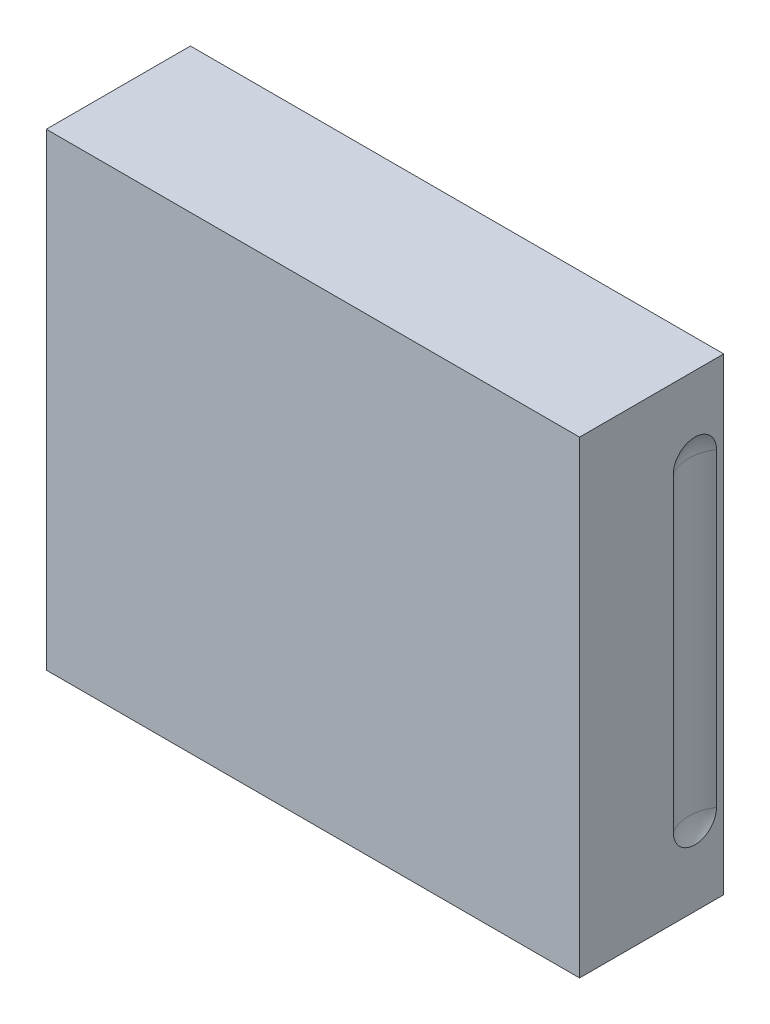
ISO-10303-21;
HEADER;
FILE_DESCRIPTION(('STEP AP214'),'2;1');
FILE_NAME('part.step','',(''),(''),'','','');
FILE_SCHEMA(('AUTOMOTIVE_DESIGN { 1 0 10303 214 1 1 1 1 }'));
ENDSEC;
DATA;
#1=APPLICATION_CONTEXT('core data for automotive mechanical design processes');
#2=APPLICATION_PROTOCOL_DEFINITION('international standard','automotive_design',2000,#1);
#3=PRODUCT_CONTEXT('',#1,'mechanical');
#4=PRODUCT('Part','Part','',(#3));
#5=PRODUCT_RELATED_PRODUCT_CATEGORY('part','',(#4));
#6=PRODUCT_DEFINITION_FORMATION('','',#4);
#7=PRODUCT_DEFINITION_CONTEXT('part definition',#1,'design');
#8=PRODUCT_DEFINITION('design','',#6,#7);
#9=PRODUCT_DEFINITION_SHAPE('','',#8);
#10=(LENGTH_UNIT() NAMED_UNIT(*) SI_UNIT(.MILLI.,.METRE.));
#11=(NAMED_UNIT(*) PLANE_ANGLE_UNIT() SI_UNIT($,.RADIAN.));
#12=(NAMED_UNIT(*) SI_UNIT($,.STERADIAN.) SOLID_ANGLE_UNIT());
#13=UNCERTAINTY_MEASURE_WITH_UNIT(LENGTH_MEASURE(1.E-05),#10,'distance_accuracy_value','');
#14=(GEOMETRIC_REPRESENTATION_CONTEXT(3) GLOBAL_UNCERTAINTY_ASSIGNED_CONTEXT((#13)) GLOBAL_UNIT_ASSIGNED_CONTEXT((#10,
#11,#12)) REPRESENTATION_CONTEXT('',''));
#15=CARTESIAN_POINT('',(0.,0.,0.));
#16=DIRECTION('',(0.,0.,1.));
#17=DIRECTION('',(1.,0.,0.));
#18=AXIS2_PLACEMENT_3D('',#15,#16,#17);
#19=CARTESIAN_POINT('',(48.9999999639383,65.,11.7));
#20=DIRECTION('',(0.,0.,1.));
#21=DIRECTION('',(1.,0.,0.));
#22=AXIS2_PLACEMENT_3D('',#19,#20,#21);
#23=PLANE('',#22);
#24=DIRECTION('',(0.,1.,0.));
#25=VECTOR('',#24,1.);
#26=CARTESIAN_POINT('',(61.,65.,11.7));
#27=LINE('',#26,#25);
#28=CARTESIAN_POINT('',(61.,43.2,11.7));
#29=VERTEX_POINT('',#28);
#30=CARTESIAN_POINT('',(61.,86.8,11.7));
#31=VERTEX_POINT('',#30);
#32=EDGE_CURVE('E123',#29,#31,#27,.T.);
#33=ORIENTED_EDGE('',*,*,#32,.F.);
#34=CARTESIAN_POINT('',(56.,43.2,11.7));
#35=DIRECTION('',(0.,0.,-1.));
#36=DIRECTION('',(-1.,0.,0.));
#37=AXIS2_PLACEMENT_3D('',#34,#35,#36);
#38=CIRCLE('',#37,5.);
#39=CARTESIAN_POINT('',(56.,38.2000000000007,11.7));
#40=VERTEX_POINT('',#39);
#41=EDGE_CURVE('E18',#40,#29,#38,.F.);
#42=ORIENTED_EDGE('',*,*,#41,.F.);
#43=DIRECTION('',(1.,0.,0.));
#44=VECTOR('',#43,1.);
#45=CARTESIAN_POINT('',(48.9999999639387,38.2000000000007,11.7));
#46=LINE('',#45,#44);
#47=CARTESIAN_POINT('',(42.,38.2,11.7));
#48=VERTEX_POINT('',#47);
#49=EDGE_CURVE('E145',#48,#40,#46,.T.);
#50=ORIENTED_EDGE('',*,*,#49,.F.);
#51=CARTESIAN_POINT('',(42.,43.2,11.7));
#52=DIRECTION('',(0.,0.,-1.));
#53=DIRECTION('',(-1.,0.,0.));
#54=AXIS2_PLACEMENT_3D('',#51,#52,#53);
#55=CIRCLE('',#54,5.);
#56=CARTESIAN_POINT('',(37.,43.2,11.7));
#57=VERTEX_POINT('',#56);
#58=EDGE_CURVE('E153',#57,#48,#55,.F.);
#59=ORIENTED_EDGE('',*,*,#58,.F.);
#60=DIRECTION('',(0.,1.,0.));
#61=VECTOR('',#60,1.);
#62=CARTESIAN_POINT('',(37.,65.,11.7));
#63=LINE('',#62,#61);
#64=CARTESIAN_POINT('',(37.,86.8,11.7));
#65=VERTEX_POINT('',#64);
#66=EDGE_CURVE('E157',#65,#57,#63,.F.);
#67=ORIENTED_EDGE('',*,*,#66,.F.);
#68=CARTESIAN_POINT('',(42.,86.8,11.7));
#69=DIRECTION('',(0.,0.,-1.));
#70=DIRECTION('',(-1.,0.,0.));
#71=AXIS2_PLACEMENT_3D('',#68,#69,#70);
#72=CIRCLE('',#71,5.);
#73=CARTESIAN_POINT('',(42.,91.8,11.7));
#74=VERTEX_POINT('',#73);
#75=EDGE_CURVE('E295',#74,#65,#72,.F.);
#76=ORIENTED_EDGE('',*,*,#75,.F.);
#77=DIRECTION('',(1.,0.,0.));
#78=VECTOR('',#77,1.);
#79=CARTESIAN_POINT('',(48.9999999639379,91.8,11.7));
#80=LINE('',#79,#78);
#81=CARTESIAN_POINT('',(56.,91.8,11.7));
#82=VERTEX_POINT('',#81);
#83=EDGE_CURVE('E291',#82,#74,#80,.F.);
#84=ORIENTED_EDGE('',*,*,#83,.F.);
#85=CARTESIAN_POINT('',(56.,86.8,11.7));
#86=DIRECTION('',(0.,0.,-1.));
#87=DIRECTION('',(-1.,0.,0.));
#88=AXIS2_PLACEMENT_3D('',#85,#86,#87);
#89=CIRCLE('',#88,5.);
#90=EDGE_CURVE('E126',#31,#82,#89,.F.);
#91=ORIENTED_EDGE('',*,*,#90,.F.);
#92=EDGE_LOOP('',(#33,#42,#50,#59,#67,#76,#84,#91));
#93=FACE_BOUND('',#92,.T.);
#94=ADVANCED_FACE('F14',(#93),#23,.F.);
#95=CARTESIAN_POINT('',(61.,65.,5.85));
#96=DIRECTION('',(-1.,0.,0.));
#97=DIRECTION('',(0.,0.,1.));
#98=AXIS2_PLACEMENT_3D('',#95,#96,#97);
#99=PLANE('',#98);
#100=DIRECTION('',(0.,0.,-1.));
#101=VECTOR('',#100,1.);
#102=CARTESIAN_POINT('',(61.,86.8,5.85));
#103=LINE('',#102,#101);
#104=CARTESIAN_POINT('',(61.,86.8,0.));
#105=VERTEX_POINT('',#104);
#106=EDGE_CURVE('E286',#105,#31,#103,.F.);
#107=ORIENTED_EDGE('',*,*,#106,.F.);
#108=DIRECTION('',(0.,1.,0.));
#109=VECTOR('',#108,1.);
#110=CARTESIAN_POINT('',(61.,65.,0.));
#111=LINE('',#110,#109);
#112=CARTESIAN_POINT('',(61.,43.2,0.));
#113=VERTEX_POINT('',#112);
#114=EDGE_CURVE('E134',#105,#113,#111,.F.);
#115=ORIENTED_EDGE('',*,*,#114,.T.);
#116=DIRECTION('',(0.,0.,-1.));
#117=VECTOR('',#116,1.);
#118=CARTESIAN_POINT('',(61.,43.2,5.85));
#119=LINE('',#118,#117);
#120=EDGE_CURVE('E131',#29,#113,#119,.T.);
#121=ORIENTED_EDGE('',*,*,#120,.F.);
#122=ORIENTED_EDGE('',*,*,#32,.T.);
#123=EDGE_LOOP('',(#107,#115,#121,#122));
#124=FACE_BOUND('',#123,.T.);
#125=ADVANCED_FACE('F132',(#124),#99,.T.);
#126=CARTESIAN_POINT('',(56.,43.2,11.7));
#127=DIRECTION('',(0.,0.,-1.));
#128=DIRECTION('',(-1.,0.,0.));
#129=AXIS2_PLACEMENT_3D('',#126,#127,#128);
#130=CYLINDRICAL_SURFACE('',#129,5.);
#131=ORIENTED_EDGE('',*,*,#120,.T.);
#132=CARTESIAN_POINT('',(56.,43.2,0.));
#133=DIRECTION('',(0.,0.,-1.));
#134=DIRECTION('',(-1.,0.,0.));
#135=AXIS2_PLACEMENT_3D('',#132,#133,#134);
#136=CIRCLE('',#135,5.);
#137=CARTESIAN_POINT('',(56.,38.2,0.));
#138=VERTEX_POINT('',#137);
#139=EDGE_CURVE('E142',#113,#138,#136,.T.);
#140=ORIENTED_EDGE('',*,*,#139,.T.);
#141=DIRECTION('',(0.,0.,1.));
#142=VECTOR('',#141,1.);
#143=CARTESIAN_POINT('',(56.,38.2000000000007,5.85));
#144=LINE('',#143,#142);
#145=EDGE_CURVE('E137',#40,#138,#144,.F.);
#146=ORIENTED_EDGE('',*,*,#145,.F.);
#147=ORIENTED_EDGE('',*,*,#41,.T.);
#148=EDGE_LOOP('',(#131,#140,#146,#147));
#149=FACE_BOUND('',#148,.T.);
#150=ADVANCED_FACE('F139',(#149),#130,.F.);
#151=CARTESIAN_POINT('',(48.9999999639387,38.2000000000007,5.85));
#152=DIRECTION('',(0.,1.,0.));
#153=DIRECTION('',(0.,0.,1.));
#154=AXIS2_PLACEMENT_3D('',#151,#152,#153);
#155=PLANE('',#154);
#156=DIRECTION('',(0.,0.,-1.));
#157=VECTOR('',#156,1.);
#158=CARTESIAN_POINT('',(42.,38.2,5.85));
#159=LINE('',#158,#157);
#160=CARTESIAN_POINT('',(42.,38.2,0.));
#161=VERTEX_POINT('',#160);
#162=EDGE_CURVE('E150',#48,#161,#159,.T.);
#163=ORIENTED_EDGE('',*,*,#162,.F.);
#164=ORIENTED_EDGE('',*,*,#49,.T.);
#165=ORIENTED_EDGE('',*,*,#145,.T.);
#166=DIRECTION('',(1.,0.,0.));
#167=VECTOR('',#166,1.);
#168=CARTESIAN_POINT('',(48.9999999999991,38.2,0.));
#169=LINE('',#168,#167);
#170=EDGE_CURVE('E321',#138,#161,#169,.F.);
#171=ORIENTED_EDGE('',*,*,#170,.T.);
#172=EDGE_LOOP('',(#163,#164,#165,#171));
#173=FACE_BOUND('',#172,.T.);
#174=ADVANCED_FACE('F148',(#173),#155,.T.);
#175=CARTESIAN_POINT('',(42.,43.2,11.7));
#176=DIRECTION('',(0.,0.,-1.));
#177=DIRECTION('',(-1.,0.,0.));
#178=AXIS2_PLACEMENT_3D('',#175,#176,#177);
#179=CYLINDRICAL_SURFACE('',#178,5.);
#180=DIRECTION('',(0.,0.,-1.));
#181=VECTOR('',#180,1.);
#182=CARTESIAN_POINT('',(37.,43.2,5.85));
#183=LINE('',#182,#181);
#184=CARTESIAN_POINT('',(37.,43.2,0.));
#185=VERTEX_POINT('',#184);
#186=EDGE_CURVE('E296',#57,#185,#183,.T.);
#187=ORIENTED_EDGE('',*,*,#186,.F.);
#188=ORIENTED_EDGE('',*,*,#58,.T.);
#189=ORIENTED_EDGE('',*,*,#162,.T.);
#190=CARTESIAN_POINT('',(42.,43.2,0.));
#191=DIRECTION('',(0.,0.,-1.));
#192=DIRECTION('',(-1.,0.,0.));
#193=AXIS2_PLACEMENT_3D('',#190,#191,#192);
#194=CIRCLE('',#193,5.);
#195=EDGE_CURVE('E317',#161,#185,#194,.T.);
#196=ORIENTED_EDGE('',*,*,#195,.T.);
#197=EDGE_LOOP('',(#187,#188,#189,#196));
#198=FACE_BOUND('',#197,.T.);
#199=ADVANCED_FACE('F332',(#198),#179,.F.);
#200=CARTESIAN_POINT('',(37.,65.,5.85));
#201=DIRECTION('',(1.,0.,0.));
#202=DIRECTION('',(0.,0.,-1.));
#203=AXIS2_PLACEMENT_3D('',#200,#201,#202);
#204=PLANE('',#203);
#205=ORIENTED_EDGE('',*,*,#186,.T.);
#206=DIRECTION('',(0.,1.,0.));
#207=VECTOR('',#206,1.);
#208=CARTESIAN_POINT('',(37.,65.,0.));
#209=LINE('',#208,#207);
#210=CARTESIAN_POINT('',(37.,86.8,0.));
#211=VERTEX_POINT('',#210);
#212=EDGE_CURVE('E314',#185,#211,#209,.T.);
#213=ORIENTED_EDGE('',*,*,#212,.T.);
#214=DIRECTION('',(0.,0.,-1.));
#215=VECTOR('',#214,1.);
#216=CARTESIAN_POINT('',(37.,86.8,5.85));
#217=LINE('',#216,#215);
#218=EDGE_CURVE('E292',#65,#211,#217,.T.);
#219=ORIENTED_EDGE('',*,*,#218,.F.);
#220=ORIENTED_EDGE('',*,*,#66,.T.);
#221=EDGE_LOOP('',(#205,#213,#219,#220));
#222=FACE_BOUND('',#221,.T.);
#223=ADVANCED_FACE('F330',(#222),#204,.T.);
#224=CARTESIAN_POINT('',(42.,86.8,11.7));
#225=DIRECTION('',(0.,0.,-1.));
#226=DIRECTION('',(-1.,0.,0.));
#227=AXIS2_PLACEMENT_3D('',#224,#225,#226);
#228=CYLINDRICAL_SURFACE('',#227,5.);
#229=ORIENTED_EDGE('',*,*,#218,.T.);
#230=CARTESIAN_POINT('',(42.,86.8,0.));
#231=DIRECTION('',(0.,0.,-1.));
#232=DIRECTION('',(-1.,0.,0.));
#233=AXIS2_PLACEMENT_3D('',#230,#231,#232);
#234=CIRCLE('',#233,5.);
#235=CARTESIAN_POINT('',(42.,91.8,0.));
#236=VERTEX_POINT('',#235);
#237=EDGE_CURVE('E311',#211,#236,#234,.T.);
#238=ORIENTED_EDGE('',*,*,#237,.T.);
#239=DIRECTION('',(0.,0.,1.));
#240=VECTOR('',#239,1.);
#241=CARTESIAN_POINT('',(42.,91.8,5.85));
#242=LINE('',#241,#240);
#243=EDGE_CURVE('E287',#74,#236,#242,.F.);
#244=ORIENTED_EDGE('',*,*,#243,.F.);
#245=ORIENTED_EDGE('',*,*,#75,.T.);
#246=EDGE_LOOP('',(#229,#238,#244,#245));
#247=FACE_BOUND('',#246,.T.);
#248=ADVANCED_FACE('F309',(#247),#228,.F.);
#249=CARTESIAN_POINT('',(48.9999999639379,91.8,5.85));
#250=DIRECTION('',(0.,-1.,0.));
#251=DIRECTION('',(1.,0.,0.));
#252=AXIS2_PLACEMENT_3D('',#249,#250,#251);
#253=PLANE('',#252);
#254=ORIENTED_EDGE('',*,*,#243,.T.);
#255=DIRECTION('',(1.,0.,0.));
#256=VECTOR('',#255,1.);
#257=CARTESIAN_POINT('',(48.9999999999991,91.8,0.));
#258=LINE('',#257,#256);
#259=CARTESIAN_POINT('',(56.,91.8,0.));
#260=VERTEX_POINT('',#259);
#261=EDGE_CURVE('E228',#236,#260,#258,.T.);
#262=ORIENTED_EDGE('',*,*,#261,.T.);
#263=DIRECTION('',(0.,0.,-1.));
#264=VECTOR('',#263,1.);
#265=CARTESIAN_POINT('',(56.,91.8,5.85));
#266=LINE('',#265,#264);
#267=EDGE_CURVE('E283',#82,#260,#266,.T.);
#268=ORIENTED_EDGE('',*,*,#267,.F.);
#269=ORIENTED_EDGE('',*,*,#83,.T.);
#270=EDGE_LOOP('',(#254,#262,#268,#269));
#271=FACE_BOUND('',#270,.T.);
#272=ADVANCED_FACE('F301',(#271),#253,.T.);
#273=CARTESIAN_POINT('',(56.,86.8,11.7));
#274=DIRECTION('',(0.,0.,-1.));
#275=DIRECTION('',(-1.,0.,0.));
#276=AXIS2_PLACEMENT_3D('',#273,#274,#275);
#277=CYLINDRICAL_SURFACE('',#276,5.);
#278=ORIENTED_EDGE('',*,*,#106,.T.);
#279=ORIENTED_EDGE('',*,*,#90,.T.);
#280=ORIENTED_EDGE('',*,*,#267,.T.);
#281=CARTESIAN_POINT('',(56.,86.8,0.));
#282=DIRECTION('',(0.,0.,-1.));
#283=DIRECTION('',(-1.,0.,0.));
#284=AXIS2_PLACEMENT_3D('',#281,#282,#283);
#285=CIRCLE('',#284,5.);
#286=EDGE_CURVE('E316',#260,#105,#285,.T.);
#287=ORIENTED_EDGE('',*,*,#286,.T.);
#288=EDGE_LOOP('',(#278,#279,#280,#287));
#289=FACE_BOUND('',#288,.T.);
#290=ADVANCED_FACE('F221',(#289),#277,.F.);
#291=CARTESIAN_POINT('',(-34.34,21.997866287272,8.));
#292=DIRECTION('',(0.888230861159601,0.275171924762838,0.367867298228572));
#293=DIRECTION('',(-0.140445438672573,0.925074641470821,-0.35286256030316));
#294=AXIS2_PLACEMENT_3D('',#291,#292,#293);
#295=SPHERICAL_SURFACE('',#294,11.1);
#296=CARTESIAN_POINT('',(-34.34,21.997866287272,8.));
#297=DIRECTION('',(0.,-1.,0.));
#298=DIRECTION('',(1.,0.,0.));
#299=AXIS2_PLACEMENT_3D('',#296,#297,#298);
#300=CIRCLE('',#299,11.1);
#301=CARTESIAN_POINT('',(-25.0000000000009,21.9978662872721,13.9978662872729));
#302=VERTEX_POINT('',#301);
#303=CARTESIAN_POINT('',(-25.0000000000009,21.9978662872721,2.00213371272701));
#304=VERTEX_POINT('',#303);
#305=EDGE_CURVE('E325',#302,#304,#300,.F.);
#306=ORIENTED_EDGE('',*,*,#305,.T.);
#307=CARTESIAN_POINT('',(-25.0000000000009,21.9978662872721,2.00213371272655));
#308=CARTESIAN_POINT('',(-25.0000000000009,21.8291744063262,2.00211557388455));
#309=CARTESIAN_POINT('',(-25.0000000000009,21.6604851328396,2.00924971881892));
#310=CARTESIAN_POINT('',(-25.0000000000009,21.3243134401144,2.03769157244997));
#311=CARTESIAN_POINT('',(-25.0000000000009,21.1568309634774,2.05899860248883));
#312=CARTESIAN_POINT('',(-25.0000000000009,20.8243750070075,2.1156353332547));
#313=CARTESIAN_POINT('',(-25.0000000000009,20.6593998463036,2.1509551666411));
#314=CARTESIAN_POINT('',(-25.0000000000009,20.3330116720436,2.23536054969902));
#315=CARTESIAN_POINT('',(-25.0000000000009,20.1715986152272,2.28444593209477));
#316=CARTESIAN_POINT('',(-25.0000000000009,19.8534338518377,2.39605139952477));
#317=CARTESIAN_POINT('',(-25.0000000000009,19.6966834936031,2.45857532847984));
#318=CARTESIAN_POINT('',(-25.0000000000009,19.3889496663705,2.59663030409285));
#319=CARTESIAN_POINT('',(-25.0000000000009,19.2379683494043,2.67216614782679));
#320=CARTESIAN_POINT('',(-25.0000000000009,18.9429914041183,2.83564546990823));
#321=CARTESIAN_POINT('',(-25.0000000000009,18.7989918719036,2.92358190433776));
#322=CARTESIAN_POINT('',(-25.0000000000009,18.5188584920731,3.11130448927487));
#323=CARTESIAN_POINT('',(-25.0000000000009,18.3827275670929,3.21109500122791));
#324=CARTESIAN_POINT('',(-25.0000000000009,18.1194027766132,3.42175358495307));
#325=CARTESIAN_POINT('',(-25.0000000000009,17.9922058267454,3.53261780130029));
#326=CARTESIAN_POINT('',(-25.0000000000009,17.7475556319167,3.76470784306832));
#327=CARTESIAN_POINT('',(-25.0000000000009,17.6301060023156,3.8859374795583));
#328=CARTESIAN_POINT('',(-25.0000000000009,17.4058624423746,4.13783366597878));
#329=CARTESIAN_POINT('',(-25.0000000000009,17.2990662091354,4.26849816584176));
#330=CARTESIAN_POINT('',(-25.0000000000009,17.0968221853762,4.53840849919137));
#331=CARTESIAN_POINT('',(-25.0000000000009,17.001378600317,4.67765748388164));
#332=CARTESIAN_POINT('',(-25.0000000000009,16.8226015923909,4.9636434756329));
#333=CARTESIAN_POINT('',(-25.0000000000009,16.739263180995,5.11037736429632));
#334=CARTESIAN_POINT('',(-25.0000000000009,16.5852133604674,5.4103987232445));
#335=CARTESIAN_POINT('',(-25.0000000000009,16.5145066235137,5.56368859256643));
#336=CARTESIAN_POINT('',(-25.0000000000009,16.3862886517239,5.87561339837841));
#337=CARTESIAN_POINT('',(-25.0000000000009,16.3287717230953,6.03424599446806));
#338=CARTESIAN_POINT('',(-25.0000000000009,16.2272842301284,6.35585112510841));
#339=CARTESIAN_POINT('',(-25.0000000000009,16.1833186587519,6.51882523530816));
#340=CARTESIAN_POINT('',(-25.0000000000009,16.1092877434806,6.84784269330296));
#341=CARTESIAN_POINT('',(-25.0000000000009,16.07921771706,7.01388498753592));
#342=CARTESIAN_POINT('',(-25.0000000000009,16.0331616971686,7.34797042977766));
#343=CARTESIAN_POINT('',(-25.0000000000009,16.0171806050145,7.51601425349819));
#344=CARTESIAN_POINT('',(-25.0000000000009,15.9994352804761,7.85282542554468));
#345=CARTESIAN_POINT('',(-25.0000000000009,15.997668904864,8.02159266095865));
#346=CARTESIAN_POINT('',(-25.0000000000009,16.0083599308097,8.35867600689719));
#347=CARTESIAN_POINT('',(-25.0000000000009,16.0208173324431,8.52699211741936));
#348=CARTESIAN_POINT('',(-25.0000000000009,16.0598705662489,8.86200405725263));
#349=CARTESIAN_POINT('',(-25.0000000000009,16.0864687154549,9.0286996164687));
#350=CARTESIAN_POINT('',(-25.0000000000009,16.1536040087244,9.35919935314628));
#351=CARTESIAN_POINT('',(-25.0000000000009,16.1941363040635,9.52300451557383));
#352=CARTESIAN_POINT('',(-25.0000000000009,16.2888706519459,9.84667630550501));
#353=CARTESIAN_POINT('',(-25.0000000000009,16.3430775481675,10.0065415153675));
#354=CARTESIAN_POINT('',(-25.0000000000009,16.4647460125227,10.3210781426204));
#355=CARTESIAN_POINT('',(-25.0000000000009,16.5322026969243,10.4757514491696));
#356=CARTESIAN_POINT('',(-25.0000000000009,16.679933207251,10.7789267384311));
#357=CARTESIAN_POINT('',(-25.0000000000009,16.7602120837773,10.9274262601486));
#358=CARTESIAN_POINT('',(-25.0000000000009,16.9329649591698,11.2170793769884));
#359=CARTESIAN_POINT('',(-25.0000000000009,17.0254344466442,11.3582356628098));
#360=CARTESIAN_POINT('',(-25.0000000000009,17.2219657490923,11.6323019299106));
#361=CARTESIAN_POINT('',(-25.0000000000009,17.3260312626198,11.7652092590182));
#362=CARTESIAN_POINT('',(-25.0000000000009,17.5449499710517,12.0217357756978));
#363=CARTESIAN_POINT('',(-25.0000000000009,17.6597991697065,12.1453583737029));
#364=CARTESIAN_POINT('',(-25.0000000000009,17.8995297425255,12.3825190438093));
#365=CARTESIAN_POINT('',(-25.0000000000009,18.0244134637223,12.4960547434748));
#366=CARTESIAN_POINT('',(-25.0000000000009,18.2832538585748,12.712161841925));
#367=CARTESIAN_POINT('',(-25.0000000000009,18.4172071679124,12.8147372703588));
#368=CARTESIAN_POINT('',(-25.0000000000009,18.6933712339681,13.0083097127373));
#369=CARTESIAN_POINT('',(-25.0000000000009,18.8355876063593,13.0992987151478));
#370=CARTESIAN_POINT('',(-25.0000000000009,19.1271283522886,13.2689369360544));
#371=CARTESIAN_POINT('',(-25.0000000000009,19.2764500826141,13.3475906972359));
#372=CARTESIAN_POINT('',(-25.0000000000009,19.5813380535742,13.4921107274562));
#373=CARTESIAN_POINT('',(-25.0000000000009,19.7369102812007,13.5579643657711));
#374=CARTESIAN_POINT('',(-25.0000000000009,20.0529952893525,13.6762965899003));
#375=CARTESIAN_POINT('',(-25.0000000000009,20.213506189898,13.7287801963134));
#376=CARTESIAN_POINT('',(-25.0000000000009,20.5381971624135,13.8199805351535));
#377=CARTESIAN_POINT('',(-25.0000000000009,20.7023729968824,13.8587123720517));
#378=CARTESIAN_POINT('',(-25.0000000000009,21.033337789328,13.9222002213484));
#379=CARTESIAN_POINT('',(-25.0000000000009,21.2001254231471,13.9469630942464));
#380=CARTESIAN_POINT('',(-25.0000000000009,21.4723744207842,13.9757308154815));
#381=CARTESIAN_POINT('',(-25.0000000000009,21.5773999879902,13.9840369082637));
#382=CARTESIAN_POINT('',(-25.0000000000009,21.7875688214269,13.9951006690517));
#383=CARTESIAN_POINT('',(-25.0000000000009,21.8927116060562,13.9978674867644));
#384=CARTESIAN_POINT('',(-25.0000000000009,21.9978662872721,13.9978662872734));
#385=B_SPLINE_CURVE_WITH_KNOTS('',3,(#307,#308,#309,#310,#311,#312,#313,#314,#315,#316,#317,
#318,#319,#320,#321,#322,#323,#324,#325,#326,#327,#328,#329,#330,#331,#332,#333,#334,#335,#336,
#337,#338,#339,#340,#341,#342,#343,#344,#345,#346,#347,#348,#349,#350,#351,#352,#353,#354,#355,
#356,#357,#358,#359,#360,#361,#362,#363,#364,#365,#366,#367,#368,#369,#370,#371,#372,#373,#374,
#375,#376,#377,#378,#379,#380,#381,#382,#383,#384),.UNSPECIFIED.,.F.,.F.,(4,2,2,2,2,2,2,2,2,2,2,
2,2,2,2,2,2,2,2,2,2,2,2,2,2,2,2,2,2,2,2,2,2,2,2,2,2,2,4),(0.,0.5059211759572,1.01181812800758,
1.51735947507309,2.02289467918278,2.52857467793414,3.03444150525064,3.54002213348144,
4.04578935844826,4.55138110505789,5.05715954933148,5.56282842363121,6.06868403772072,
6.57433059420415,7.08016379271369,7.58577821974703,8.09157871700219,8.5972086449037,
9.10301440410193,9.60874389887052,10.1144733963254,10.6202857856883,11.1259223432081,
11.6317382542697,12.137368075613,12.6431975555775,13.1488403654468,13.6546449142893,
14.160262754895,14.6659992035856,15.1715490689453,15.6774466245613,16.1831574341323,
16.6893647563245,17.1953817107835,17.7008411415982,18.2060521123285,18.5219783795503,
18.8373823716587),.UNSPECIFIED.);
#386=EDGE_CURVE('E203',#304,#302,#385,.T.);
#387=ORIENTED_EDGE('',*,*,#386,.T.);
#388=EDGE_LOOP('',(#306,#387));
#389=FACE_BOUND('',#388,.T.);
#390=ADVANCED_FACE('F214',(#389),#295,.F.);
#391=CARTESIAN_POINT('',(-34.34,21.997866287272,8.));
#392=DIRECTION('',(0.,-1.,0.));
#393=DIRECTION('',(1.,0.,0.));
#394=AXIS2_PLACEMENT_3D('',#391,#392,#393);
#395=CYLINDRICAL_SURFACE('',#394,11.1);
#396=DIRECTION('',(0.,1.,0.));
#397=VECTOR('',#396,1.);
#398=CARTESIAN_POINT('',(-25.0000000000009,65.,13.9978662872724));
#399=LINE('',#398,#397);
#400=CARTESIAN_POINT('',(-25.0000000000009,108.002133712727,13.9978662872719));
#401=VERTEX_POINT('',#400);
#402=EDGE_CURVE('E210',#302,#401,#399,.T.);
#403=ORIENTED_EDGE('',*,*,#402,.T.);
#404=CARTESIAN_POINT('',(-34.3400000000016,108.002133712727,8.));
#405=DIRECTION('',(0.,-1.,0.));
#406=DIRECTION('',(1.,0.,0.));
#407=AXIS2_PLACEMENT_3D('',#404,#405,#406);
#408=CIRCLE('',#407,11.1);
#409=CARTESIAN_POINT('',(-25.0000000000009,108.002133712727,2.00213371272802));
#410=VERTEX_POINT('',#409);
#411=EDGE_CURVE('E323',#401,#410,#408,.F.);
#412=ORIENTED_EDGE('',*,*,#411,.T.);
#413=DIRECTION('',(0.,1.,0.));
#414=VECTOR('',#413,1.);
#415=CARTESIAN_POINT('',(-25.0000000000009,65.,2.0021337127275));
#416=LINE('',#415,#414);
#417=EDGE_CURVE('E211',#410,#304,#416,.F.);
#418=ORIENTED_EDGE('',*,*,#417,.T.);
#419=ORIENTED_EDGE('',*,*,#305,.F.);
#420=EDGE_LOOP('',(#403,#412,#418,#419));
#421=FACE_BOUND('',#420,.T.);
#422=ADVANCED_FACE('F220',(#421),#395,.F.);
#423=CARTESIAN_POINT('',(-34.3400000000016,108.002133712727,8.));
#424=DIRECTION('',(0.888230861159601,0.275171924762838,0.367867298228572));
#425=DIRECTION('',(-0.140445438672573,0.925074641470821,-0.35286256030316));
#426=AXIS2_PLACEMENT_3D('',#423,#424,#425);
#427=SPHERICAL_SURFACE('',#426,11.1);
#428=CARTESIAN_POINT('',(-24.48063744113,111.056542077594,12.0833270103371));
#429=VERTEX_POINT('',#428);
#430=VERTEX_LOOP('',#429);
#431=FACE_BOUND('',#430,.T.);
#432=ORIENTED_EDGE('',*,*,#411,.F.);
#433=CARTESIAN_POINT('',(-25.0000000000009,108.002133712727,13.9978662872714));
#434=CARTESIAN_POINT('',(-25.0000000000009,108.170825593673,13.9978844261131));
#435=CARTESIAN_POINT('',(-25.0000000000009,108.33951486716,13.9907502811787));
#436=CARTESIAN_POINT('',(-25.0000000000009,108.675686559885,13.9623084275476));
#437=CARTESIAN_POINT('',(-25.0000000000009,108.843169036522,13.9410013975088));
#438=CARTESIAN_POINT('',(-25.0000000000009,109.175624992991,13.8843646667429));
#439=CARTESIAN_POINT('',(-25.0000000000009,109.340600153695,13.8490448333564));
#440=CARTESIAN_POINT('',(-25.0000000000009,109.666988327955,13.7646394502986));
#441=CARTESIAN_POINT('',(-25.0000000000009,109.828401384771,13.7155540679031));
#442=CARTESIAN_POINT('',(-25.0000000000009,110.146566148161,13.6039486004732));
#443=CARTESIAN_POINT('',(-25.0000000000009,110.303316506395,13.5414246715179));
#444=CARTESIAN_POINT('',(-25.0000000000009,110.611050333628,13.4033696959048));
#445=CARTESIAN_POINT('',(-25.0000000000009,110.762031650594,13.3278338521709));
#446=CARTESIAN_POINT('',(-25.0000000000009,111.05700859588,13.1643545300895));
#447=CARTESIAN_POINT('',(-25.0000000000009,111.201008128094,13.07641809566));
#448=CARTESIAN_POINT('',(-25.0000000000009,111.481141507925,12.8886955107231));
#449=CARTESIAN_POINT('',(-25.0000000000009,111.617272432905,12.7889049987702));
#450=CARTESIAN_POINT('',(-25.0000000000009,111.880597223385,12.5782464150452));
#451=CARTESIAN_POINT('',(-25.0000000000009,112.007794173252,12.4673821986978));
#452=CARTESIAN_POINT('',(-25.0000000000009,112.252444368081,12.2352921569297));
#453=CARTESIAN_POINT('',(-25.0000000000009,112.369893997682,12.1140625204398));
#454=CARTESIAN_POINT('',(-25.0000000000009,112.594137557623,11.8621663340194));
#455=CARTESIAN_POINT('',(-25.0000000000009,112.700933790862,11.7315018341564));
#456=CARTESIAN_POINT('',(-25.0000000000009,112.903177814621,11.461591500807));
#457=CARTESIAN_POINT('',(-25.0000000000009,112.99862139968,11.3223425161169));
#458=CARTESIAN_POINT('',(-25.0000000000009,113.177398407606,11.0363565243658));
#459=CARTESIAN_POINT('',(-25.0000000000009,113.260736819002,10.8896226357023));
#460=CARTESIAN_POINT('',(-25.0000000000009,113.414786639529,10.5896012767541));
#461=CARTESIAN_POINT('',(-25.0000000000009,113.485493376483,10.4363114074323));
#462=CARTESIAN_POINT('',(-25.0000000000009,113.613711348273,10.1243866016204));
#463=CARTESIAN_POINT('',(-25.0000000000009,113.671228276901,9.96575400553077));
#464=CARTESIAN_POINT('',(-25.0000000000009,113.772715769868,9.64414887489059));
#465=CARTESIAN_POINT('',(-25.0000000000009,113.816681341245,9.48117476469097));
#466=CARTESIAN_POINT('',(-25.0000000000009,113.890712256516,9.15215730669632));
#467=CARTESIAN_POINT('',(-25.0000000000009,113.920782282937,8.98611501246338));
#468=CARTESIAN_POINT('',(-25.0000000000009,113.966838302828,8.65202957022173));
#469=CARTESIAN_POINT('',(-25.0000000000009,113.982819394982,8.48398574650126));
#470=CARTESIAN_POINT('',(-25.0000000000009,114.00056471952,8.14717457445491));
#471=CARTESIAN_POINT('',(-25.0000000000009,114.002331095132,7.978407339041));
#472=CARTESIAN_POINT('',(-25.0000000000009,113.991640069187,7.64132399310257));
#473=CARTESIAN_POINT('',(-25.0000000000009,113.979182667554,7.47300788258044));
#474=CARTESIAN_POINT('',(-25.0000000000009,113.940129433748,7.13799594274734));
#475=CARTESIAN_POINT('',(-25.0000000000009,113.913531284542,6.97130038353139));
#476=CARTESIAN_POINT('',(-25.0000000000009,113.846395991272,6.64080064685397));
#477=CARTESIAN_POINT('',(-25.0000000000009,113.805863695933,6.47699548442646));
#478=CARTESIAN_POINT('',(-25.0000000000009,113.711129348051,6.15332369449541));
#479=CARTESIAN_POINT('',(-25.0000000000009,113.656922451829,5.99345848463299));
#480=CARTESIAN_POINT('',(-25.0000000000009,113.535253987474,5.67892185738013));
#481=CARTESIAN_POINT('',(-25.0000000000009,113.467797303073,5.52424855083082));
#482=CARTESIAN_POINT('',(-25.0000000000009,113.320066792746,5.22107326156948));
#483=CARTESIAN_POINT('',(-25.0000000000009,113.23978791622,5.07257373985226));
#484=CARTESIAN_POINT('',(-25.0000000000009,113.067035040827,4.78292062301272));
#485=CARTESIAN_POINT('',(-25.0000000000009,112.974565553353,4.64176433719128));
#486=CARTESIAN_POINT('',(-25.0000000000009,112.778034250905,4.36769807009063));
#487=CARTESIAN_POINT('',(-25.0000000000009,112.673968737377,4.23479074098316));
#488=CARTESIAN_POINT('',(-25.0000000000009,112.455050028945,3.97826422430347));
#489=CARTESIAN_POINT('',(-25.0000000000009,112.340200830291,3.85464162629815));
#490=CARTESIAN_POINT('',(-25.0000000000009,112.100470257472,3.61748095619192));
#491=CARTESIAN_POINT('',(-25.0000000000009,111.975586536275,3.50394525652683));
#492=CARTESIAN_POINT('',(-25.0000000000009,111.716746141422,3.28783815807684));
#493=CARTESIAN_POINT('',(-25.0000000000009,111.582792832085,3.18526272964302));
#494=CARTESIAN_POINT('',(-25.0000000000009,111.306628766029,2.99169028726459));
#495=CARTESIAN_POINT('',(-25.0000000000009,111.164412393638,2.90070128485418));
#496=CARTESIAN_POINT('',(-25.0000000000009,110.872871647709,2.73106306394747));
#497=CARTESIAN_POINT('',(-25.0000000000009,110.723549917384,2.65240930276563));
#498=CARTESIAN_POINT('',(-25.0000000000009,110.418661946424,2.50788927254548));
#499=CARTESIAN_POINT('',(-25.0000000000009,110.263089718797,2.44203563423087));
#500=CARTESIAN_POINT('',(-25.0000000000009,109.947004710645,2.32370341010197));
#501=CARTESIAN_POINT('',(-25.0000000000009,109.7864938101,2.27121980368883));
#502=CARTESIAN_POINT('',(-25.0000000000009,109.461802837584,2.18001946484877));
#503=CARTESIAN_POINT('',(-25.0000000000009,109.297627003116,2.14128762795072));
#504=CARTESIAN_POINT('',(-25.0000000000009,108.96666221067,2.07779977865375));
#505=CARTESIAN_POINT('',(-25.0000000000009,108.799874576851,2.05303690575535));
#506=CARTESIAN_POINT('',(-25.0000000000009,108.527625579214,2.02426918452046));
#507=CARTESIAN_POINT('',(-25.0000000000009,108.422600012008,2.01596309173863));
#508=CARTESIAN_POINT('',(-25.0000000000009,108.212431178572,2.00489933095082));
#509=CARTESIAN_POINT('',(-25.0000000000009,108.107288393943,2.00213251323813));
#510=CARTESIAN_POINT('',(-25.0000000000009,108.002133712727,2.00213371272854));
#511=B_SPLINE_CURVE_WITH_KNOTS('',3,(#433,#434,#435,#436,#437,#438,#439,#440,#441,#442,#443,
#444,#445,#446,#447,#448,#449,#450,#451,#452,#453,#454,#455,#456,#457,#458,#459,#460,#461,#462,
#463,#464,#465,#466,#467,#468,#469,#470,#471,#472,#473,#474,#475,#476,#477,#478,#479,#480,#481,
#482,#483,#484,#485,#486,#487,#488,#489,#490,#491,#492,#493,#494,#495,#496,#497,#498,#499,#500,
#501,#502,#503,#504,#505,#506,#507,#508,#509,#510),.UNSPECIFIED.,.F.,.F.,(4,2,2,2,2,2,2,2,2,2,2,
2,2,2,2,2,2,2,2,2,2,2,2,2,2,2,2,2,2,2,2,2,2,2,2,2,2,2,4),(0.,0.505921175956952,1.01181812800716,
1.51735947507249,2.02289467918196,2.52857467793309,3.03444150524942,3.54002213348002,
4.04578935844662,4.55138110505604,5.05715954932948,5.56282842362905,6.06868403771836,
6.57433059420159,7.08016379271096,7.58577821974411,8.09157871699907,8.59720864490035,
9.10301440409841,9.60874389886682,10.1144733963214,10.6202857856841,11.1259223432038,
11.6317382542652,12.1373680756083,12.6431975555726,13.1488403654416,13.654644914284,
14.1602627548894,14.6659992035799,15.1715490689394,15.6774466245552,16.1831574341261,
16.689364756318,17.1953817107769,17.7008411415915,18.2060521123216,18.5219783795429,
18.8373823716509),.UNSPECIFIED.);
#512=EDGE_CURVE('E196',#401,#410,#511,.T.);
#513=ORIENTED_EDGE('',*,*,#512,.T.);
#514=EDGE_LOOP('',(#432,#513));
#515=FACE_BOUND('',#514,.T.);
#516=ADVANCED_FACE('F230',(#431,#515),#427,.F.);
#517=CARTESIAN_POINT('',(48.9999999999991,65.,0.));
#518=DIRECTION('',(0.,0.,1.));
#519=DIRECTION('',(1.,0.,0.));
#520=AXIS2_PLACEMENT_3D('',#517,#518,#519);
#521=PLANE('',#520);
#522=DIRECTION('',(0.,1.,0.));
#523=VECTOR('',#522,1.);
#524=CARTESIAN_POINT('',(-25.0000000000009,65.,0.));
#525=LINE('',#524,#523);
#526=CARTESIAN_POINT('',(-25.0000000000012,-1.10245146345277E-13,0.));
#527=VERTEX_POINT('',#526);
#528=CARTESIAN_POINT('',(-25.0000000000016,130.,0.));
#529=VERTEX_POINT('',#528);
#530=EDGE_CURVE('E252',#527,#529,#525,.T.);
#531=ORIENTED_EDGE('',*,*,#530,.T.);
#532=DIRECTION('',(1.,0.,0.));
#533=VECTOR('',#532,1.);
#534=CARTESIAN_POINT('',(48.9999999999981,130.,0.));
#535=LINE('',#534,#533);
#536=CARTESIAN_POINT('',(123.,130.000000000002,0.));
#537=VERTEX_POINT('',#536);
#538=EDGE_CURVE('E249',#529,#537,#535,.T.);
#539=ORIENTED_EDGE('',*,*,#538,.T.);
#540=DIRECTION('',(0.,-1.,0.));
#541=VECTOR('',#540,1.);
#542=CARTESIAN_POINT('',(123.,65.0000000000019,0.));
#543=LINE('',#542,#541);
#544=CARTESIAN_POINT('',(123.,4.48335812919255E-13,0.));
#545=VERTEX_POINT('',#544);
#546=EDGE_CURVE('E262',#537,#545,#543,.T.);
#547=ORIENTED_EDGE('',*,*,#546,.T.);
#548=DIRECTION('',(1.,0.,0.));
#549=VECTOR('',#548,1.);
#550=CARTESIAN_POINT('',(49.,7.24753590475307E-13,0.));
#551=LINE('',#550,#549);
#552=EDGE_CURVE('E263',#545,#527,#551,.F.);
#553=ORIENTED_EDGE('',*,*,#552,.T.);
#554=EDGE_LOOP('',(#531,#539,#547,#553));
#555=FACE_BOUND('',#554,.T.);
#556=ORIENTED_EDGE('',*,*,#261,.F.);
#557=ORIENTED_EDGE('',*,*,#237,.F.);
#558=ORIENTED_EDGE('',*,*,#212,.F.);
#559=ORIENTED_EDGE('',*,*,#195,.F.);
#560=ORIENTED_EDGE('',*,*,#170,.F.);
#561=ORIENTED_EDGE('',*,*,#139,.F.);
#562=ORIENTED_EDGE('',*,*,#114,.F.);
#563=ORIENTED_EDGE('',*,*,#286,.F.);
#564=EDGE_LOOP('',(#556,#557,#558,#559,#560,#561,#562,#563));
#565=FACE_BOUND('',#564,.T.);
#566=ADVANCED_FACE('F234',(#555,#565),#521,.F.);
#567=CARTESIAN_POINT('',(132.34,21.9978662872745,8.));
#568=DIRECTION('',(0.888230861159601,0.275171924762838,0.367867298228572));
#569=DIRECTION('',(-0.140445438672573,0.925074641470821,-0.35286256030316));
#570=AXIS2_PLACEMENT_3D('',#567,#568,#569);
#571=SPHERICAL_SURFACE('',#570,11.1);
#572=CARTESIAN_POINT('',(122.480637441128,18.9434579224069,3.91667298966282));
#573=VERTEX_POINT('',#572);
#574=VERTEX_LOOP('',#573);
#575=FACE_BOUND('',#574,.T.);
#576=CARTESIAN_POINT('',(132.34,21.9978662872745,8.));
#577=DIRECTION('',(0.,1.,0.));
#578=DIRECTION('',(-1.,0.,0.));
#579=AXIS2_PLACEMENT_3D('',#576,#577,#578);
#580=CIRCLE('',#579,11.1);
#581=CARTESIAN_POINT('',(123.,21.9978662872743,2.0021337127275));
#582=VERTEX_POINT('',#581);
#583=CARTESIAN_POINT('',(123.,21.9978662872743,13.9978662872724));
#584=VERTEX_POINT('',#583);
#585=EDGE_CURVE('E520',#582,#584,#580,.T.);
#586=ORIENTED_EDGE('',*,*,#585,.T.);
#587=CARTESIAN_POINT('',(123.,21.9978662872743,13.9978662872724));
#588=CARTESIAN_POINT('',(123.,21.8291744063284,13.9978844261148));
#589=CARTESIAN_POINT('',(123.000000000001,21.6604851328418,13.9907502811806));
#590=CARTESIAN_POINT('',(123.000000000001,21.3243134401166,13.9623084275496));
#591=CARTESIAN_POINT('',(123.000000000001,21.1568309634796,13.9410013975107));
#592=CARTESIAN_POINT('',(123.000000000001,20.8243750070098,13.8843646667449));
#593=CARTESIAN_POINT('',(123.000000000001,20.6593998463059,13.8490448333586));
#594=CARTESIAN_POINT('',(123.,20.333011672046,13.7646394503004));
#595=CARTESIAN_POINT('',(123.,20.1715986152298,13.7155540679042));
#596=CARTESIAN_POINT('',(123.,19.8534338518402,13.6039486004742));
#597=CARTESIAN_POINT('',(123.000000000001,19.6966834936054,13.5414246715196));
#598=CARTESIAN_POINT('',(123.000000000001,19.3889496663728,13.4033696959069));
#599=CARTESIAN_POINT('',(123.000000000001,19.2379683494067,13.3278338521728));
#600=CARTESIAN_POINT('',(123.000000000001,18.9429914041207,13.1643545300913));
#601=CARTESIAN_POINT('',(123.000000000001,18.798991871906,13.0764180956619));
#602=CARTESIAN_POINT('',(123.000000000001,18.5188584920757,12.8886955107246));
#603=CARTESIAN_POINT('',(123.,18.3827275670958,12.7889049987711));
#604=CARTESIAN_POINT('',(123.,18.1194027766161,12.578246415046));
#605=CARTESIAN_POINT('',(123.000000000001,17.9922058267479,12.4673821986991));
#606=CARTESIAN_POINT('',(123.000000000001,17.7475556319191,12.2352921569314));
#607=CARTESIAN_POINT('',(123.000000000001,17.6301060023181,12.1140625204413));
#608=CARTESIAN_POINT('',(123.000000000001,17.4058624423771,11.8621663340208));
#609=CARTESIAN_POINT('',(123.000000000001,17.2990662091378,11.7315018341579));
#610=CARTESIAN_POINT('',(123.000000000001,17.0968221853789,11.4615915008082));
#611=CARTESIAN_POINT('',(123.,17.0013786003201,11.3223425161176));
#612=CARTESIAN_POINT('',(123.,16.822601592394,11.0363565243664));
#613=CARTESIAN_POINT('',(123.000000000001,16.7392631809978,10.8896226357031));
#614=CARTESIAN_POINT('',(123.000000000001,16.58521336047,10.5896012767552));
#615=CARTESIAN_POINT('',(123.000000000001,16.5145066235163,10.4363114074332));
#616=CARTESIAN_POINT('',(123.000000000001,16.3862886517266,10.1243866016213));
#617=CARTESIAN_POINT('',(123.000000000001,16.3287717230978,9.96575400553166));
#618=CARTESIAN_POINT('',(123.000000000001,16.2272842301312,9.64414887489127));
#619=CARTESIAN_POINT('',(123.,16.1833186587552,9.48117476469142));
#620=CARTESIAN_POINT('',(123.,16.1092877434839,9.1521573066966));
#621=CARTESIAN_POINT('',(123.000000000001,16.0792177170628,8.98611501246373));
#622=CARTESIAN_POINT('',(123.000000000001,16.0331616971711,8.65202957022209));
#623=CARTESIAN_POINT('',(123.000000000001,16.0171806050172,8.48398574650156));
#624=CARTESIAN_POINT('',(123.000000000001,15.9994352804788,8.1471745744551));
#625=CARTESIAN_POINT('',(123.000000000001,15.9976689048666,7.97840733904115));
#626=CARTESIAN_POINT('',(123.000000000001,16.0083599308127,7.64132399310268));
#627=CARTESIAN_POINT('',(123.,16.0208173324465,7.47300788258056));
#628=CARTESIAN_POINT('',(123.,16.0598705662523,7.13799594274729));
#629=CARTESIAN_POINT('',(123.000000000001,16.0864687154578,6.97130038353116));
#630=CARTESIAN_POINT('',(123.000000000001,16.1536040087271,6.64080064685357));
#631=CARTESIAN_POINT('',(123.000000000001,16.1941363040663,6.47699548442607));
#632=CARTESIAN_POINT('',(123.000000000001,16.2888706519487,6.15332369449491));
#633=CARTESIAN_POINT('',(123.000000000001,16.3430775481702,5.99345848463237));
#634=CARTESIAN_POINT('',(123.000000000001,16.4647460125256,5.67892185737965));
#635=CARTESIAN_POINT('',(123.,16.5322026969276,5.52424855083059));
#636=CARTESIAN_POINT('',(123.,16.6799332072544,5.22107326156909));
#637=CARTESIAN_POINT('',(123.000000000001,16.7602120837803,5.07257373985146));
#638=CARTESIAN_POINT('',(123.000000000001,16.9329649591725,4.78292062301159));
#639=CARTESIAN_POINT('',(123.000000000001,17.0254344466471,4.64176433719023));
#640=CARTESIAN_POINT('',(123.000000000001,17.2219657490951,4.36769807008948));
#641=CARTESIAN_POINT('',(123.000000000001,17.3260312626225,4.23479074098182));
#642=CARTESIAN_POINT('',(123.000000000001,17.5449499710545,3.97826422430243));
#643=CARTESIAN_POINT('',(123.,17.6597991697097,3.8546416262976));
#644=CARTESIAN_POINT('',(123.,17.8995297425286,3.61748095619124));
#645=CARTESIAN_POINT('',(123.000000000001,18.0244134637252,3.50394525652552));
#646=CARTESIAN_POINT('',(123.000000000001,18.2832538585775,3.28783815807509));
#647=CARTESIAN_POINT('',(123.000000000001,18.4172071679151,3.18526272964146));
#648=CARTESIAN_POINT('',(123.000000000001,18.6933712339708,2.99169028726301));
#649=CARTESIAN_POINT('',(123.000000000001,18.8355876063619,2.90070128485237));
#650=CARTESIAN_POINT('',(123.000000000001,19.1271283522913,2.73106306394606));
#651=CARTESIAN_POINT('',(123.,19.2764500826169,2.65240930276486));
#652=CARTESIAN_POINT('',(123.,19.581338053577,2.50788927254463));
#653=CARTESIAN_POINT('',(123.000000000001,19.7369102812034,2.44203563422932));
#654=CARTESIAN_POINT('',(123.000000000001,20.052995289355,2.32370341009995));
#655=CARTESIAN_POINT('',(123.000000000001,20.2135061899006,2.27121980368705));
#656=CARTESIAN_POINT('',(123.000000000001,20.5381971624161,2.18001946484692));
#657=CARTESIAN_POINT('',(123.000000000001,20.7023729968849,2.14128762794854));
#658=CARTESIAN_POINT('',(123.,21.0333377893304,2.07779977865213));
#659=CARTESIAN_POINT('',(123.,21.2001254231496,2.05303690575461));
#660=CARTESIAN_POINT('',(123.,21.4723744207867,2.02426918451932));
#661=CARTESIAN_POINT('',(123.,21.5773999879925,2.0159630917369));
#662=CARTESIAN_POINT('',(123.000000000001,21.7875688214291,2.00489933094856));
#663=CARTESIAN_POINT('',(123.000000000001,21.8927116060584,2.00213251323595));
#664=CARTESIAN_POINT('',(123.,21.9978662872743,2.00213371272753));
#665=B_SPLINE_CURVE_WITH_KNOTS('',3,(#587,#588,#589,#590,#591,#592,#593,#594,#595,#596,#597,
#598,#599,#600,#601,#602,#603,#604,#605,#606,#607,#608,#609,#610,#611,#612,#613,#614,#615,#616,
#617,#618,#619,#620,#621,#622,#623,#624,#625,#626,#627,#628,#629,#630,#631,#632,#633,#634,#635,
#636,#637,#638,#639,#640,#641,#642,#643,#644,#645,#646,#647,#648,#649,#650,#651,#652,#653,#654,
#655,#656,#657,#658,#659,#660,#661,#662,#663,#664),.UNSPECIFIED.,.F.,.F.,(4,2,2,2,2,2,2,2,2,2,2,
2,2,2,2,2,2,2,2,2,2,2,2,2,2,2,2,2,2,2,2,2,2,2,2,2,2,2,4),(0.,0.505921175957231,1.01181812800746,
1.51735947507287,2.02289467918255,2.52857467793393,3.03444150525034,3.54002213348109,
4.04578935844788,4.55138110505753,5.05715954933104,5.56282842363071,6.06868403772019,
6.57433059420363,7.08016379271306,7.58577821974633,8.09157871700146,8.59720864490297,
9.10301440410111,9.60874389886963,10.1144733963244,10.6202857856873,11.1259223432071,
11.6317382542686,12.137368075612,12.6431975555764,13.1488403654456,13.654644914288,
14.1602627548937,14.6659992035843,15.1715490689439,15.6774466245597,16.1831574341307,
16.6893647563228,17.1953817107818,17.7008411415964,18.2060521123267,18.5219783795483,
18.8373823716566),.UNSPECIFIED.);
#666=EDGE_CURVE('E169',#584,#582,#665,.T.);
#667=ORIENTED_EDGE('',*,*,#666,.T.);
#668=EDGE_LOOP('',(#586,#667));
#669=FACE_BOUND('',#668,.T.);
#670=ADVANCED_FACE('F237',(#575,#669),#571,.F.);
#671=CARTESIAN_POINT('',(132.34,21.9978662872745,8.));
#672=DIRECTION('',(0.,1.,0.));
#673=DIRECTION('',(-1.,0.,0.));
#674=AXIS2_PLACEMENT_3D('',#671,#672,#673);
#675=CYLINDRICAL_SURFACE('',#674,11.1);
#676=DIRECTION('',(0.,-1.,0.));
#677=VECTOR('',#676,1.);
#678=CARTESIAN_POINT('',(123.,65.0000000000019,13.9978662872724));
#679=LINE('',#678,#677);
#680=CARTESIAN_POINT('',(122.999999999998,108.002133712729,13.9978662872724));
#681=VERTEX_POINT('',#680);
#682=EDGE_CURVE('E267',#681,#584,#679,.T.);
#683=ORIENTED_EDGE('',*,*,#682,.T.);
#684=ORIENTED_EDGE('',*,*,#585,.F.);
#685=DIRECTION('',(0.,-1.,0.));
#686=VECTOR('',#685,1.);
#687=CARTESIAN_POINT('',(123.,65.0000000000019,2.0021337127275));
#688=LINE('',#687,#686);
#689=CARTESIAN_POINT('',(122.999999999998,108.002133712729,2.00213371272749));
#690=VERTEX_POINT('',#689);
#691=EDGE_CURVE('E168',#582,#690,#688,.F.);
#692=ORIENTED_EDGE('',*,*,#691,.T.);
#693=CARTESIAN_POINT('',(132.339999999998,108.002133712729,8.));
#694=DIRECTION('',(0.,1.,0.));
#695=DIRECTION('',(-1.,0.,0.));
#696=AXIS2_PLACEMENT_3D('',#693,#694,#695);
#697=CIRCLE('',#696,11.1);
#698=EDGE_CURVE('E212',#690,#681,#697,.T.);
#699=ORIENTED_EDGE('',*,*,#698,.T.);
#700=EDGE_LOOP('',(#683,#684,#692,#699));
#701=FACE_BOUND('',#700,.T.);
#702=ADVANCED_FACE('F242',(#701),#675,.F.);
#703=CARTESIAN_POINT('',(132.339999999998,108.002133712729,8.));
#704=DIRECTION('',(0.888230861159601,0.275171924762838,0.367867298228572));
#705=DIRECTION('',(-0.140445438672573,0.925074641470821,-0.35286256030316));
#706=AXIS2_PLACEMENT_3D('',#703,#704,#705);
#707=SPHERICAL_SURFACE('',#706,11.1);
#708=ORIENTED_EDGE('',*,*,#698,.F.);
#709=CARTESIAN_POINT('',(122.999999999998,108.002133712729,2.00213371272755));
#710=CARTESIAN_POINT('',(122.999999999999,108.170825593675,2.00211557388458));
#711=CARTESIAN_POINT('',(122.999999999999,108.339514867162,2.00924971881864));
#712=CARTESIAN_POINT('',(122.999999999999,108.675686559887,2.03769157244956));
#713=CARTESIAN_POINT('',(122.999999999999,108.843169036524,2.05899860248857));
#714=CARTESIAN_POINT('',(122.999999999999,109.175624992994,2.11563533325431));
#715=CARTESIAN_POINT('',(123.,109.340600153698,2.15095516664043));
#716=CARTESIAN_POINT('',(122.999999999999,109.666988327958,2.23536054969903));
#717=CARTESIAN_POINT('',(122.999999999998,109.828401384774,2.28444593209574));
#718=CARTESIAN_POINT('',(122.999999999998,110.146566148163,2.39605139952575));
#719=CARTESIAN_POINT('',(122.999999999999,110.303316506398,2.45857532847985));
#720=CARTESIAN_POINT('',(123.,110.611050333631,2.59663030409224));
#721=CARTESIAN_POINT('',(122.999999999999,110.762031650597,2.67216614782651));
#722=CARTESIAN_POINT('',(122.999999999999,111.057008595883,2.83564546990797));
#723=CARTESIAN_POINT('',(123.,111.201008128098,2.92358190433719));
#724=CARTESIAN_POINT('',(122.999999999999,111.481141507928,3.11130448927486));
#725=CARTESIAN_POINT('',(122.999999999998,111.617272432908,3.21109500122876));
#726=CARTESIAN_POINT('',(122.999999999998,111.880597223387,3.42175358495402));
#727=CARTESIAN_POINT('',(122.999999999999,112.007794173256,3.53261780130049));
#728=CARTESIAN_POINT('',(123.,112.252444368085,3.76470784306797));
#729=CARTESIAN_POINT('',(122.999999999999,112.369893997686,3.88593747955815));
#730=CARTESIAN_POINT('',(122.999999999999,112.594137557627,4.13783366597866));
#731=CARTESIAN_POINT('',(123.,112.700933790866,4.26849816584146));
#732=CARTESIAN_POINT('',(122.999999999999,112.903177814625,4.53840849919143));
#733=CARTESIAN_POINT('',(122.999999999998,112.998621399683,4.67765748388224));
#734=CARTESIAN_POINT('',(122.999999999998,113.17739840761,4.96364347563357));
#735=CARTESIAN_POINT('',(122.999999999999,113.260736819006,5.11037736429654));
#736=CARTESIAN_POINT('',(123.,113.414786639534,5.41039872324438));
#737=CARTESIAN_POINT('',(122.999999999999,113.485493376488,5.56368859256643));
#738=CARTESIAN_POINT('',(122.999999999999,113.613711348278,5.87561339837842));
#739=CARTESIAN_POINT('',(123.,113.671228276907,6.03424599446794));
#740=CARTESIAN_POINT('',(122.999999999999,113.772715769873,6.35585112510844));
#741=CARTESIAN_POINT('',(122.999999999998,113.816681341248,6.51882523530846));
#742=CARTESIAN_POINT('',(122.999999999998,113.89071225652,6.84784269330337));
#743=CARTESIAN_POINT('',(122.999999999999,113.920782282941,7.01388498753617));
#744=CARTESIAN_POINT('',(123.,113.966838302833,7.34797042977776));
#745=CARTESIAN_POINT('',(122.999999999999,113.982819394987,7.51601425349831));
#746=CARTESIAN_POINT('',(122.999999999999,114.000564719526,7.8528254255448));
#747=CARTESIAN_POINT('',(123.,114.002331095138,8.02159266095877));
#748=CARTESIAN_POINT('',(122.999999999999,113.991640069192,8.35867600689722));
#749=CARTESIAN_POINT('',(122.999999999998,113.979182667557,8.52699211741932));
#750=CARTESIAN_POINT('',(122.999999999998,113.940129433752,8.86200405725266));
#751=CARTESIAN_POINT('',(122.999999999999,113.913531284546,9.02869961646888));
#752=CARTESIAN_POINT('',(123.,113.846395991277,9.35919935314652));
#753=CARTESIAN_POINT('',(122.999999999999,113.805863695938,9.52300451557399));
#754=CARTESIAN_POINT('',(122.999999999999,113.711129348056,9.84667630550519));
#755=CARTESIAN_POINT('',(123.,113.656922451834,10.0065415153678));
#756=CARTESIAN_POINT('',(122.999999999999,113.535253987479,10.3210781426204));
#757=CARTESIAN_POINT('',(122.999999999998,113.467797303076,10.4757514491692));
#758=CARTESIAN_POINT('',(122.999999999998,113.320066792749,10.7789267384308));
#759=CARTESIAN_POINT('',(122.999999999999,113.239787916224,10.9274262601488));
#760=CARTESIAN_POINT('',(123.,113.067035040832,11.2170793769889));
#761=CARTESIAN_POINT('',(122.999999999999,112.974565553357,11.3582356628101));
#762=CARTESIAN_POINT('',(122.999999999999,112.778034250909,11.6323019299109));
#763=CARTESIAN_POINT('',(123.,112.673968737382,11.7652092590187));
#764=CARTESIAN_POINT('',(122.999999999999,112.45505002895,12.0217357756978));
#765=CARTESIAN_POINT('',(122.999999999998,112.340200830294,12.1453583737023));
#766=CARTESIAN_POINT('',(122.999999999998,112.100470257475,12.3825190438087));
#767=CARTESIAN_POINT('',(122.999999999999,111.975586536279,12.4960547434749));
#768=CARTESIAN_POINT('',(123.,111.716746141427,12.7121618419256));
#769=CARTESIAN_POINT('',(122.999999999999,111.582792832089,12.8147372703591));
#770=CARTESIAN_POINT('',(122.999999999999,111.306628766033,13.0083097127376));
#771=CARTESIAN_POINT('',(123.,111.164412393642,13.0992987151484));
#772=CARTESIAN_POINT('',(122.999999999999,110.872871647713,13.2689369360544));
#773=CARTESIAN_POINT('',(122.999999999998,110.723549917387,13.3475906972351));
#774=CARTESIAN_POINT('',(122.999999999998,110.418661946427,13.4921107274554));
#775=CARTESIAN_POINT('',(122.999999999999,110.2630897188,13.5579643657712));
#776=CARTESIAN_POINT('',(123.,109.947004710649,13.6762965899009));
#777=CARTESIAN_POINT('',(122.999999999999,109.786493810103,13.7287801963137));
#778=CARTESIAN_POINT('',(122.999999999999,109.461802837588,13.8199805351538));
#779=CARTESIAN_POINT('',(123.,109.297627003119,13.8587123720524));
#780=CARTESIAN_POINT('',(122.999999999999,108.966662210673,13.9222002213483));
#781=CARTESIAN_POINT('',(122.999999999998,108.799874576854,13.9469630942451));
#782=CARTESIAN_POINT('',(122.999999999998,108.527625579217,13.9757308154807));
#783=CARTESIAN_POINT('',(122.999999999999,108.422600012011,13.9840369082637));
#784=CARTESIAN_POINT('',(123.,108.212431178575,13.9951006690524));
#785=CARTESIAN_POINT('',(123.,108.107288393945,13.997867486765));
#786=CARTESIAN_POINT('',(122.999999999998,108.002133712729,13.9978662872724));
#787=B_SPLINE_CURVE_WITH_KNOTS('',3,(#709,#710,#711,#712,#713,#714,#715,#716,#717,#718,#719,
#720,#721,#722,#723,#724,#725,#726,#727,#728,#729,#730,#731,#732,#733,#734,#735,#736,#737,#738,
#739,#740,#741,#742,#743,#744,#745,#746,#747,#748,#749,#750,#751,#752,#753,#754,#755,#756,#757,
#758,#759,#760,#761,#762,#763,#764,#765,#766,#767,#768,#769,#770,#771,#772,#773,#774,#775,#776,
#777,#778,#779,#780,#781,#782,#783,#784,#785,#786),.UNSPECIFIED.,.F.,.F.,(4,2,2,2,2,2,2,2,2,2,2,
2,2,2,2,2,2,2,2,2,2,2,2,2,2,2,2,2,2,2,2,2,2,2,2,2,2,2,4),(0.,0.505921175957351,1.01181812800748,
1.51735947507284,2.02289467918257,2.52857467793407,3.03444150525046,3.54002213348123,
4.04578935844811,4.55138110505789,5.05715954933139,5.56282842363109,6.06868403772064,
6.57433059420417,7.08016379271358,7.58577821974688,8.09157871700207,8.5972086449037,
9.10301440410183,9.60874389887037,10.1144733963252,10.6202857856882,11.125922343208,
11.6317382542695,12.1373680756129,12.6431975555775,13.1488403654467,13.6546449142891,
14.1602627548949,14.6659992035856,15.1715490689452,15.677446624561,16.1831574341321,
16.6893647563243,17.1953817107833,17.7008411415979,18.2060521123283,18.5219783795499,
18.8373823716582),.UNSPECIFIED.);
#788=EDGE_CURVE('E159',#690,#681,#787,.T.);
#789=ORIENTED_EDGE('',*,*,#788,.T.);
#790=EDGE_LOOP('',(#708,#789));
#791=FACE_BOUND('',#790,.T.);
#792=ADVANCED_FACE('F176',(#791),#707,.F.);
#793=CARTESIAN_POINT('',(48.9999999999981,130.,20.));
#794=DIRECTION('',(0.,-1.,0.));
#795=DIRECTION('',(1.,0.,0.));
#796=AXIS2_PLACEMENT_3D('',#793,#794,#795);
#797=PLANE('',#796);
#798=DIRECTION('',(1.,0.,0.));
#799=VECTOR('',#798,1.);
#800=CARTESIAN_POINT('',(48.9999999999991,130.000000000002,40.));
#801=LINE('',#800,#799);
#802=CARTESIAN_POINT('',(122.999999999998,130.000000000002,40.));
#803=VERTEX_POINT('',#802);
#804=CARTESIAN_POINT('',(-25.0000000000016,130.,40.));
#805=VERTEX_POINT('',#804);
#806=EDGE_CURVE('E167',#803,#805,#801,.F.);
#807=ORIENTED_EDGE('',*,*,#806,.F.);
#808=DIRECTION('',(0.,0.,1.));
#809=VECTOR('',#808,1.);
#810=CARTESIAN_POINT('',(122.999999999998,130.000000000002,20.));
#811=LINE('',#810,#809);
#812=EDGE_CURVE('E270',#803,#537,#811,.F.);
#813=ORIENTED_EDGE('',*,*,#812,.T.);
#814=ORIENTED_EDGE('',*,*,#538,.F.);
#815=DIRECTION('',(0.,0.,-1.));
#816=VECTOR('',#815,1.);
#817=CARTESIAN_POINT('',(-25.0000000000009,130.,20.));
#818=LINE('',#817,#816);
#819=EDGE_CURVE('E256',#529,#805,#818,.F.);
#820=ORIENTED_EDGE('',*,*,#819,.T.);
#821=EDGE_LOOP('',(#807,#813,#814,#820));
#822=FACE_BOUND('',#821,.T.);
#823=ADVANCED_FACE('F193',(#822),#797,.F.);
#824=CARTESIAN_POINT('',(-25.0000000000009,65.,20.));
#825=DIRECTION('',(1.,0.,0.));
#826=DIRECTION('',(0.,0.,-1.));
#827=AXIS2_PLACEMENT_3D('',#824,#825,#826);
#828=PLANE('',#827);
#829=ORIENTED_EDGE('',*,*,#402,.F.);
#830=ORIENTED_EDGE('',*,*,#386,.F.);
#831=ORIENTED_EDGE('',*,*,#417,.F.);
#832=ORIENTED_EDGE('',*,*,#512,.F.);
#833=EDGE_LOOP('',(#829,#830,#831,#832));
#834=FACE_BOUND('',#833,.T.);
#835=DIRECTION('',(0.,1.,0.));
#836=VECTOR('',#835,1.);
#837=CARTESIAN_POINT('',(-25.0000000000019,65.,40.));
#838=LINE('',#837,#836);
#839=CARTESIAN_POINT('',(-25.0000000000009,-1.10245146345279E-13,40.));
#840=VERTEX_POINT('',#839);
#841=EDGE_CURVE('E278',#805,#840,#838,.F.);
#842=ORIENTED_EDGE('',*,*,#841,.F.);
#843=ORIENTED_EDGE('',*,*,#819,.F.);
#844=ORIENTED_EDGE('',*,*,#530,.F.);
#845=DIRECTION('',(0.,0.,1.));
#846=VECTOR('',#845,1.);
#847=CARTESIAN_POINT('',(-25.,7.24753590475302E-13,20.));
#848=LINE('',#847,#846);
#849=EDGE_CURVE('E260',#527,#840,#848,.T.);
#850=ORIENTED_EDGE('',*,*,#849,.T.);
#851=EDGE_LOOP('',(#842,#843,#844,#850));
#852=FACE_BOUND('',#851,.T.);
#853=ADVANCED_FACE('F190',(#834,#852),#828,.F.);
#854=CARTESIAN_POINT('',(49.,7.24753590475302E-13,20.));
#855=DIRECTION('',(0.,1.,0.));
#856=DIRECTION('',(0.,0.,1.));
#857=AXIS2_PLACEMENT_3D('',#854,#855,#856);
#858=PLANE('',#857);
#859=DIRECTION('',(1.,0.,0.));
#860=VECTOR('',#859,1.);
#861=CARTESIAN_POINT('',(48.9999999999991,-3.88578058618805E-13,40.));
#862=LINE('',#861,#860);
#863=CARTESIAN_POINT('',(123.,7.26668725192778E-13,40.));
#864=VERTEX_POINT('',#863);
#865=EDGE_CURVE('E24',#840,#864,#862,.T.);
#866=ORIENTED_EDGE('',*,*,#865,.F.);
#867=ORIENTED_EDGE('',*,*,#849,.F.);
#868=ORIENTED_EDGE('',*,*,#552,.F.);
#869=DIRECTION('',(0.,0.,1.));
#870=VECTOR('',#869,1.);
#871=CARTESIAN_POINT('',(123.,1.84574577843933E-12,20.));
#872=LINE('',#871,#870);
#873=EDGE_CURVE('E33',#545,#864,#872,.T.);
#874=ORIENTED_EDGE('',*,*,#873,.T.);
#875=EDGE_LOOP('',(#866,#867,#868,#874));
#876=FACE_BOUND('',#875,.T.);
#877=ADVANCED_FACE('F185',(#876),#858,.F.);
#878=CARTESIAN_POINT('',(123.,65.0000000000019,20.));
#879=DIRECTION('',(-1.,0.,0.));
#880=DIRECTION('',(0.,-1.,0.));
#881=AXIS2_PLACEMENT_3D('',#878,#879,#880);
#882=PLANE('',#881);
#883=ORIENTED_EDGE('',*,*,#691,.F.);
#884=ORIENTED_EDGE('',*,*,#666,.F.);
#885=ORIENTED_EDGE('',*,*,#682,.F.);
#886=ORIENTED_EDGE('',*,*,#788,.F.);
#887=EDGE_LOOP('',(#883,#884,#885,#886));
#888=FACE_BOUND('',#887,.T.);
#889=DIRECTION('',(0.,1.,0.));
#890=VECTOR('',#889,1.);
#891=CARTESIAN_POINT('',(123.,65.,40.));
#892=LINE('',#891,#890);
#893=EDGE_CURVE('E9',#864,#803,#892,.T.);
#894=ORIENTED_EDGE('',*,*,#893,.F.);
#895=ORIENTED_EDGE('',*,*,#873,.F.);
#896=ORIENTED_EDGE('',*,*,#546,.F.);
#897=ORIENTED_EDGE('',*,*,#812,.F.);
#898=EDGE_LOOP('',(#894,#895,#896,#897));
#899=FACE_BOUND('',#898,.T.);
#900=ADVANCED_FACE('F181',(#888,#899),#882,.F.);
#901=CARTESIAN_POINT('',(48.9999999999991,65.,40.));
#902=DIRECTION('',(0.,0.,1.));
#903=DIRECTION('',(1.,0.,0.));
#904=AXIS2_PLACEMENT_3D('',#901,#902,#903);
#905=PLANE('',#904);
#906=ORIENTED_EDGE('',*,*,#865,.T.);
#907=ORIENTED_EDGE('',*,*,#893,.T.);
#908=ORIENTED_EDGE('',*,*,#806,.T.);
#909=ORIENTED_EDGE('',*,*,#841,.T.);
#910=EDGE_LOOP('',(#906,#907,#908,#909));
#911=FACE_BOUND('',#910,.T.);
#912=ADVANCED_FACE('F16',(#911),#905,.T.);
#913=CLOSED_SHELL('',(#94,#125,#150,#174,#199,#223,#248,#272,#290,#390,#422,#516,#566,#670,#702,
#792,#823,#853,#877,#900,#912));
#914=MANIFOLD_SOLID_BREP('B1',#913);
#915=ADVANCED_BREP_SHAPE_REPRESENTATION('',(#18,#914),#14);
#916=SHAPE_DEFINITION_REPRESENTATION(#9,#915);
ENDSEC;
END-ISO-10303-21;
